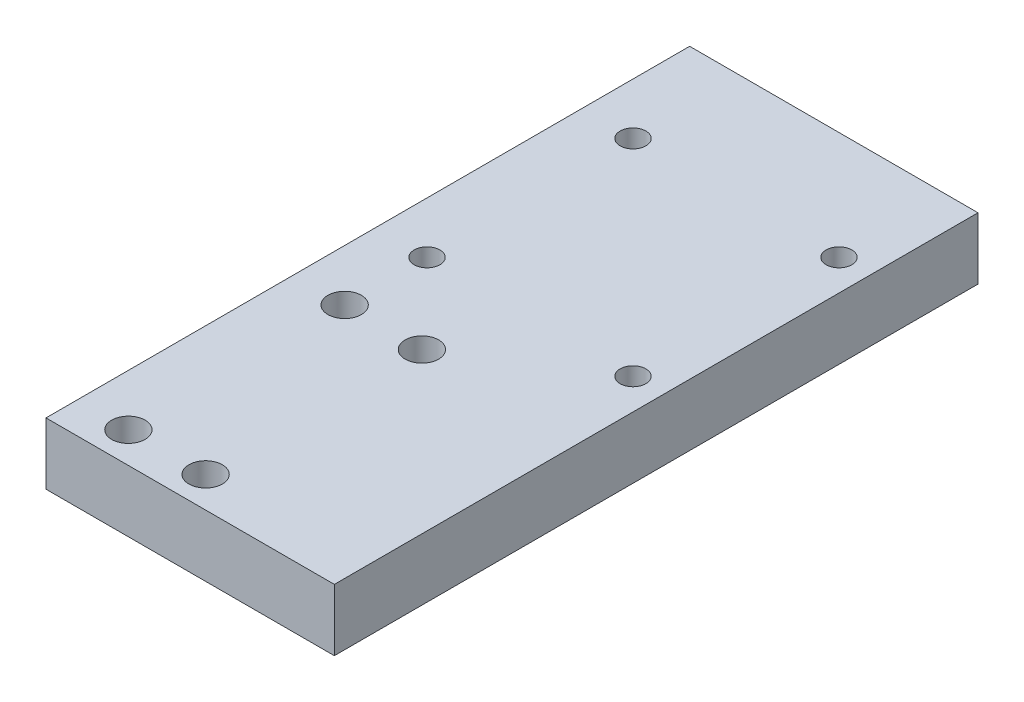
ISO-10303-21;
HEADER;
FILE_DESCRIPTION(('STEP AP214'),'2;1');
FILE_NAME('part.step','',(''),(''),'','','');
FILE_SCHEMA(('AUTOMOTIVE_DESIGN { 1 0 10303 214 1 1 1 1 }'));
ENDSEC;
DATA;
#1=APPLICATION_CONTEXT('core data for automotive mechanical design processes');
#2=APPLICATION_PROTOCOL_DEFINITION('international standard','automotive_design',2000,#1);
#3=PRODUCT_CONTEXT('',#1,'mechanical');
#4=PRODUCT('Part','Part','',(#3));
#5=PRODUCT_RELATED_PRODUCT_CATEGORY('part','',(#4));
#6=PRODUCT_DEFINITION_FORMATION('','',#4);
#7=PRODUCT_DEFINITION_CONTEXT('part definition',#1,'design');
#8=PRODUCT_DEFINITION('design','',#6,#7);
#9=PRODUCT_DEFINITION_SHAPE('','',#8);
#10=(LENGTH_UNIT() NAMED_UNIT(*) SI_UNIT(.MILLI.,.METRE.));
#11=(NAMED_UNIT(*) PLANE_ANGLE_UNIT() SI_UNIT($,.RADIAN.));
#12=(NAMED_UNIT(*) SI_UNIT($,.STERADIAN.) SOLID_ANGLE_UNIT());
#13=UNCERTAINTY_MEASURE_WITH_UNIT(LENGTH_MEASURE(1.E-05),#10,'distance_accuracy_value','');
#14=(GEOMETRIC_REPRESENTATION_CONTEXT(3) GLOBAL_UNCERTAINTY_ASSIGNED_CONTEXT((#13)) GLOBAL_UNIT_ASSIGNED_CONTEXT((#10,
#11,#12)) REPRESENTATION_CONTEXT('',''));
#15=CARTESIAN_POINT('',(0.,0.,0.));
#16=DIRECTION('',(0.,0.,1.));
#17=DIRECTION('',(1.,0.,0.));
#18=AXIS2_PLACEMENT_3D('',#15,#16,#17);
#19=CARTESIAN_POINT('',(10.0000000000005,-113.,77.));
#20=DIRECTION('',(0.,1.,0.));
#21=DIRECTION('',(-1.,0.,0.));
#22=AXIS2_PLACEMENT_3D('',#19,#20,#21);
#23=CYLINDRICAL_SURFACE('',#22,3.25);
#24=CARTESIAN_POINT('',(9.99999999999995,12.,77.));
#25=DIRECTION('',(0.,1.,0.));
#26=DIRECTION('',(-1.,0.,0.));
#27=AXIS2_PLACEMENT_3D('',#24,#25,#26);
#28=CIRCLE('',#27,3.25);
#29=CARTESIAN_POINT('',(6.74999999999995,12.,77.));
#30=VERTEX_POINT('',#29);
#31=EDGE_CURVE('E102',#30,#30,#28,.T.);
#32=ORIENTED_EDGE('',*,*,#31,.T.);
#33=EDGE_LOOP('',(#32));
#34=FACE_BOUND('',#33,.T.);
#35=CARTESIAN_POINT('',(9.99999999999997,6.50000000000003,77.));
#36=DIRECTION('',(0.,-1.,0.));
#37=DIRECTION('',(1.,0.,0.));
#38=AXIS2_PLACEMENT_3D('',#35,#36,#37);
#39=CIRCLE('',#38,3.25);
#40=CARTESIAN_POINT('',(13.25,6.50000000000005,77.));
#41=VERTEX_POINT('',#40);
#42=EDGE_CURVE('E36',#41,#41,#39,.F.);
#43=ORIENTED_EDGE('',*,*,#42,.F.);
#44=EDGE_LOOP('',(#43));
#45=FACE_BOUND('',#44,.T.);
#46=ADVANCED_FACE('F32',(#34,#45),#23,.F.);
#47=CARTESIAN_POINT('',(25.0000000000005,-113.,77.));
#48=DIRECTION('',(0.,1.,0.));
#49=DIRECTION('',(-1.,0.,0.));
#50=AXIS2_PLACEMENT_3D('',#47,#48,#49);
#51=CYLINDRICAL_SURFACE('',#50,3.25);
#52=CARTESIAN_POINT('',(25.,12.0000000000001,77.));
#53=DIRECTION('',(0.,1.,0.));
#54=DIRECTION('',(-1.,0.,0.));
#55=AXIS2_PLACEMENT_3D('',#52,#53,#54);
#56=CIRCLE('',#55,3.25);
#57=CARTESIAN_POINT('',(21.75,12.0000000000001,77.));
#58=VERTEX_POINT('',#57);
#59=EDGE_CURVE('E165',#58,#58,#56,.T.);
#60=ORIENTED_EDGE('',*,*,#59,.T.);
#61=EDGE_LOOP('',(#60));
#62=FACE_BOUND('',#61,.T.);
#63=CARTESIAN_POINT('',(25.,6.5000000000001,77.));
#64=DIRECTION('',(0.,-1.,0.));
#65=DIRECTION('',(1.,0.,0.));
#66=AXIS2_PLACEMENT_3D('',#63,#64,#65);
#67=CIRCLE('',#66,3.25);
#68=CARTESIAN_POINT('',(28.25,6.50000000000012,77.));
#69=VERTEX_POINT('',#68);
#70=EDGE_CURVE('E117',#69,#69,#67,.F.);
#71=ORIENTED_EDGE('',*,*,#70,.F.);
#72=EDGE_LOOP('',(#71));
#73=FACE_BOUND('',#72,.T.);
#74=ADVANCED_FACE('F191',(#62,#73),#51,.F.);
#75=CARTESIAN_POINT('',(25.0000000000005,-113.,119.));
#76=DIRECTION('',(0.,1.,0.));
#77=DIRECTION('',(-1.,0.,0.));
#78=AXIS2_PLACEMENT_3D('',#75,#76,#77);
#79=CYLINDRICAL_SURFACE('',#78,3.25);
#80=CARTESIAN_POINT('',(25.,12.0000000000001,119.));
#81=DIRECTION('',(0.,1.,0.));
#82=DIRECTION('',(-1.,0.,0.));
#83=AXIS2_PLACEMENT_3D('',#80,#81,#82);
#84=CIRCLE('',#83,3.25);
#85=CARTESIAN_POINT('',(21.75,12.0000000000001,119.));
#86=VERTEX_POINT('',#85);
#87=EDGE_CURVE('E168',#86,#86,#84,.T.);
#88=ORIENTED_EDGE('',*,*,#87,.T.);
#89=EDGE_LOOP('',(#88));
#90=FACE_BOUND('',#89,.T.);
#91=CARTESIAN_POINT('',(25.,6.5000000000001,119.));
#92=DIRECTION('',(0.,-1.,0.));
#93=DIRECTION('',(1.,0.,0.));
#94=AXIS2_PLACEMENT_3D('',#91,#92,#93);
#95=CIRCLE('',#94,3.25);
#96=CARTESIAN_POINT('',(28.25,6.50000000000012,119.));
#97=VERTEX_POINT('',#96);
#98=EDGE_CURVE('E113',#97,#97,#95,.F.);
#99=ORIENTED_EDGE('',*,*,#98,.F.);
#100=EDGE_LOOP('',(#99));
#101=FACE_BOUND('',#100,.T.);
#102=ADVANCED_FACE('F196',(#90,#101),#79,.F.);
#103=CARTESIAN_POINT('',(10.0000000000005,-113.,119.));
#104=DIRECTION('',(0.,1.,0.));
#105=DIRECTION('',(-1.,0.,0.));
#106=AXIS2_PLACEMENT_3D('',#103,#104,#105);
#107=CYLINDRICAL_SURFACE('',#106,3.25);
#108=CARTESIAN_POINT('',(9.99999999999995,12.,119.));
#109=DIRECTION('',(0.,1.,0.));
#110=DIRECTION('',(-1.,0.,0.));
#111=AXIS2_PLACEMENT_3D('',#108,#109,#110);
#112=CIRCLE('',#111,3.25);
#113=CARTESIAN_POINT('',(6.74999999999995,12.,119.));
#114=VERTEX_POINT('',#113);
#115=EDGE_CURVE('E171',#114,#114,#112,.T.);
#116=ORIENTED_EDGE('',*,*,#115,.T.);
#117=EDGE_LOOP('',(#116));
#118=FACE_BOUND('',#117,.T.);
#119=CARTESIAN_POINT('',(9.99999999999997,6.50000000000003,119.));
#120=DIRECTION('',(0.,-1.,0.));
#121=DIRECTION('',(1.,0.,0.));
#122=AXIS2_PLACEMENT_3D('',#119,#120,#121);
#123=CIRCLE('',#122,3.25);
#124=CARTESIAN_POINT('',(13.25,6.50000000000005,119.));
#125=VERTEX_POINT('',#124);
#126=EDGE_CURVE('E108',#125,#125,#123,.F.);
#127=ORIENTED_EDGE('',*,*,#126,.F.);
#128=EDGE_LOOP('',(#127));
#129=FACE_BOUND('',#128,.T.);
#130=ADVANCED_FACE('F201',(#118,#129),#107,.F.);
#131=CARTESIAN_POINT('',(0.,0.,125.));
#132=DIRECTION('',(0.,1.,0.));
#133=DIRECTION('',(-1.,0.,0.));
#134=AXIS2_PLACEMENT_3D('',#131,#132,#133);
#135=PLANE('',#134);
#136=CARTESIAN_POINT('',(10.,0.,77.));
#137=DIRECTION('',(0.,-1.,0.));
#138=DIRECTION('',(1.,0.,0.));
#139=AXIS2_PLACEMENT_3D('',#136,#137,#138);
#140=CIRCLE('',#139,5.5);
#141=CARTESIAN_POINT('',(15.5,0.,77.));
#142=VERTEX_POINT('',#141);
#143=EDGE_CURVE('E133',#142,#142,#140,.T.);
#144=ORIENTED_EDGE('',*,*,#143,.F.);
#145=EDGE_LOOP('',(#144));
#146=FACE_BOUND('',#145,.T.);
#147=CARTESIAN_POINT('',(25.,1.01506105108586E-13,77.));
#148=DIRECTION('',(0.,-1.,0.));
#149=DIRECTION('',(1.,0.,0.));
#150=AXIS2_PLACEMENT_3D('',#147,#148,#149);
#151=CIRCLE('',#150,5.5);
#152=CARTESIAN_POINT('',(30.5,1.24032728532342E-13,77.));
#153=VERTEX_POINT('',#152);
#154=EDGE_CURVE('E126',#153,#153,#151,.T.);
#155=ORIENTED_EDGE('',*,*,#154,.F.);
#156=EDGE_LOOP('',(#155));
#157=FACE_BOUND('',#156,.T.);
#158=CARTESIAN_POINT('',(25.,1.01506105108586E-13,119.));
#159=DIRECTION('',(0.,-1.,0.));
#160=DIRECTION('',(1.,0.,0.));
#161=AXIS2_PLACEMENT_3D('',#158,#159,#160);
#162=CIRCLE('',#161,5.5);
#163=CARTESIAN_POINT('',(30.5,1.24032728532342E-13,119.));
#164=VERTEX_POINT('',#163);
#165=EDGE_CURVE('E119',#164,#164,#162,.T.);
#166=ORIENTED_EDGE('',*,*,#165,.F.);
#167=EDGE_LOOP('',(#166));
#168=FACE_BOUND('',#167,.T.);
#169=CARTESIAN_POINT('',(10.,0.,119.));
#170=DIRECTION('',(0.,-1.,0.));
#171=DIRECTION('',(1.,0.,0.));
#172=AXIS2_PLACEMENT_3D('',#169,#170,#171);
#173=CIRCLE('',#172,5.5);
#174=CARTESIAN_POINT('',(15.5,0.,119.));
#175=VERTEX_POINT('',#174);
#176=EDGE_CURVE('E115',#175,#175,#173,.T.);
#177=ORIENTED_EDGE('',*,*,#176,.F.);
#178=EDGE_LOOP('',(#177));
#179=FACE_BOUND('',#178,.T.);
#180=CARTESIAN_POINT('',(10.,0.,61.));
#181=DIRECTION('',(0.,1.,0.));
#182=DIRECTION('',(-1.,0.,0.));
#183=AXIS2_PLACEMENT_3D('',#180,#181,#182);
#184=CIRCLE('',#183,2.5);
#185=CARTESIAN_POINT('',(7.5,0.,61.));
#186=VERTEX_POINT('',#185);
#187=EDGE_CURVE('E144',#186,#186,#184,.T.);
#188=ORIENTED_EDGE('',*,*,#187,.T.);
#189=EDGE_LOOP('',(#188));
#190=FACE_BOUND('',#189,.T.);
#191=CARTESIAN_POINT('',(50.,2.08166817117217E-13,61.));
#192=DIRECTION('',(0.,1.,0.));
#193=DIRECTION('',(-1.,0.,0.));
#194=AXIS2_PLACEMENT_3D('',#191,#192,#193);
#195=CIRCLE('',#194,2.5);
#196=CARTESIAN_POINT('',(47.5,1.98016206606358E-13,61.));
#197=VERTEX_POINT('',#196);
#198=EDGE_CURVE('E150',#197,#197,#195,.T.);
#199=ORIENTED_EDGE('',*,*,#198,.T.);
#200=EDGE_LOOP('',(#199));
#201=FACE_BOUND('',#200,.T.);
#202=CARTESIAN_POINT('',(50.,2.08166817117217E-13,21.));
#203=DIRECTION('',(0.,1.,0.));
#204=DIRECTION('',(-1.,0.,0.));
#205=AXIS2_PLACEMENT_3D('',#202,#203,#204);
#206=CIRCLE('',#205,2.5);
#207=CARTESIAN_POINT('',(47.5,1.98016206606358E-13,21.));
#208=VERTEX_POINT('',#207);
#209=EDGE_CURVE('E156',#208,#208,#206,.T.);
#210=ORIENTED_EDGE('',*,*,#209,.T.);
#211=EDGE_LOOP('',(#210));
#212=FACE_BOUND('',#211,.T.);
#213=CARTESIAN_POINT('',(10.,0.,21.));
#214=DIRECTION('',(0.,1.,0.));
#215=DIRECTION('',(-1.,0.,0.));
#216=AXIS2_PLACEMENT_3D('',#213,#214,#215);
#217=CIRCLE('',#216,2.5);
#218=CARTESIAN_POINT('',(7.5,0.,21.));
#219=VERTEX_POINT('',#218);
#220=EDGE_CURVE('E162',#219,#219,#217,.T.);
#221=ORIENTED_EDGE('',*,*,#220,.T.);
#222=EDGE_LOOP('',(#221));
#223=FACE_BOUND('',#222,.T.);
#224=DIRECTION('',(1.,0.,0.));
#225=VECTOR('',#224,1.);
#226=CARTESIAN_POINT('',(0.,0.,0.));
#227=LINE('',#226,#225);
#228=CARTESIAN_POINT('',(0.,0.,0.));
#229=VERTEX_POINT('',#228);
#230=CARTESIAN_POINT('',(56.,2.27373675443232E-13,0.));
#231=VERTEX_POINT('',#230);
#232=EDGE_CURVE('E99',#229,#231,#227,.T.);
#233=ORIENTED_EDGE('',*,*,#232,.T.);
#234=DIRECTION('',(0.,0.,-1.));
#235=VECTOR('',#234,1.);
#236=CARTESIAN_POINT('',(56.,2.27373675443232E-13,125.));
#237=LINE('',#236,#235);
#238=CARTESIAN_POINT('',(56.,2.27373675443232E-13,125.));
#239=VERTEX_POINT('',#238);
#240=EDGE_CURVE('E11',#239,#231,#237,.T.);
#241=ORIENTED_EDGE('',*,*,#240,.F.);
#242=DIRECTION('',(1.,0.,0.));
#243=VECTOR('',#242,1.);
#244=CARTESIAN_POINT('',(0.,0.,125.));
#245=LINE('',#244,#243);
#246=CARTESIAN_POINT('',(0.,0.,125.));
#247=VERTEX_POINT('',#246);
#248=EDGE_CURVE('E86',#247,#239,#245,.T.);
#249=ORIENTED_EDGE('',*,*,#248,.F.);
#250=DIRECTION('',(0.,0.,-1.));
#251=VECTOR('',#250,1.);
#252=CARTESIAN_POINT('',(0.,0.,125.));
#253=LINE('',#252,#251);
#254=EDGE_CURVE('E95',#247,#229,#253,.T.);
#255=ORIENTED_EDGE('',*,*,#254,.T.);
#256=EDGE_LOOP('',(#233,#241,#249,#255));
#257=FACE_BOUND('',#256,.T.);
#258=ADVANCED_FACE('F34',(#146,#157,#168,#179,#190,#201,#212,#223,#257),#135,.F.);
#259=CARTESIAN_POINT('',(56.,2.27373675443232E-13,125.));
#260=DIRECTION('',(-1.,0.,0.));
#261=DIRECTION('',(0.,0.,1.));
#262=AXIS2_PLACEMENT_3D('',#259,#260,#261);
#263=PLANE('',#262);
#264=DIRECTION('',(0.,1.,0.));
#265=VECTOR('',#264,1.);
#266=CARTESIAN_POINT('',(56.,2.27373675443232E-13,0.));
#267=LINE('',#266,#265);
#268=CARTESIAN_POINT('',(56.,12.0000000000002,0.));
#269=VERTEX_POINT('',#268);
#270=EDGE_CURVE('E90',#231,#269,#267,.T.);
#271=ORIENTED_EDGE('',*,*,#270,.T.);
#272=DIRECTION('',(0.,0.,-1.));
#273=VECTOR('',#272,1.);
#274=CARTESIAN_POINT('',(56.,12.0000000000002,125.));
#275=LINE('',#274,#273);
#276=CARTESIAN_POINT('',(56.,12.0000000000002,125.));
#277=VERTEX_POINT('',#276);
#278=EDGE_CURVE('E42',#277,#269,#275,.T.);
#279=ORIENTED_EDGE('',*,*,#278,.F.);
#280=DIRECTION('',(0.,1.,0.));
#281=VECTOR('',#280,1.);
#282=CARTESIAN_POINT('',(56.,2.27373675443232E-13,125.));
#283=LINE('',#282,#281);
#284=EDGE_CURVE('E81',#239,#277,#283,.T.);
#285=ORIENTED_EDGE('',*,*,#284,.F.);
#286=ORIENTED_EDGE('',*,*,#240,.T.);
#287=EDGE_LOOP('',(#271,#279,#285,#286));
#288=FACE_BOUND('',#287,.T.);
#289=ADVANCED_FACE('F89',(#288),#263,.F.);
#290=CARTESIAN_POINT('',(0.,12.,125.));
#291=DIRECTION('',(0.,-1.,0.));
#292=DIRECTION('',(1.,0.,0.));
#293=AXIS2_PLACEMENT_3D('',#290,#291,#292);
#294=PLANE('',#293);
#295=CARTESIAN_POINT('',(9.99999999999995,12.,61.));
#296=DIRECTION('',(0.,1.,0.));
#297=DIRECTION('',(-1.,0.,0.));
#298=AXIS2_PLACEMENT_3D('',#295,#296,#297);
#299=CIRCLE('',#298,2.5);
#300=CARTESIAN_POINT('',(7.49999999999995,12.,61.));
#301=VERTEX_POINT('',#300);
#302=EDGE_CURVE('E111',#301,#301,#299,.T.);
#303=ORIENTED_EDGE('',*,*,#302,.F.);
#304=EDGE_LOOP('',(#303));
#305=FACE_BOUND('',#304,.T.);
#306=CARTESIAN_POINT('',(50.,12.0000000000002,61.));
#307=DIRECTION('',(0.,1.,0.));
#308=DIRECTION('',(-1.,0.,0.));
#309=AXIS2_PLACEMENT_3D('',#306,#307,#308);
#310=CIRCLE('',#309,2.5);
#311=CARTESIAN_POINT('',(47.5,12.0000000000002,61.));
#312=VERTEX_POINT('',#311);
#313=EDGE_CURVE('E147',#312,#312,#310,.T.);
#314=ORIENTED_EDGE('',*,*,#313,.F.);
#315=EDGE_LOOP('',(#314));
#316=FACE_BOUND('',#315,.T.);
#317=CARTESIAN_POINT('',(50.,12.0000000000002,21.));
#318=DIRECTION('',(0.,1.,0.));
#319=DIRECTION('',(-1.,0.,0.));
#320=AXIS2_PLACEMENT_3D('',#317,#318,#319);
#321=CIRCLE('',#320,2.5);
#322=CARTESIAN_POINT('',(47.5,12.0000000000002,21.));
#323=VERTEX_POINT('',#322);
#324=EDGE_CURVE('E153',#323,#323,#321,.T.);
#325=ORIENTED_EDGE('',*,*,#324,.F.);
#326=EDGE_LOOP('',(#325));
#327=FACE_BOUND('',#326,.T.);
#328=CARTESIAN_POINT('',(9.99999999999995,12.,21.));
#329=DIRECTION('',(0.,1.,0.));
#330=DIRECTION('',(-1.,0.,0.));
#331=AXIS2_PLACEMENT_3D('',#328,#329,#330);
#332=CIRCLE('',#331,2.5);
#333=CARTESIAN_POINT('',(7.49999999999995,12.,21.));
#334=VERTEX_POINT('',#333);
#335=EDGE_CURVE('E159',#334,#334,#332,.T.);
#336=ORIENTED_EDGE('',*,*,#335,.F.);
#337=EDGE_LOOP('',(#336));
#338=FACE_BOUND('',#337,.T.);
#339=ORIENTED_EDGE('',*,*,#59,.F.);
#340=EDGE_LOOP('',(#339));
#341=FACE_BOUND('',#340,.T.);
#342=ORIENTED_EDGE('',*,*,#87,.F.);
#343=EDGE_LOOP('',(#342));
#344=FACE_BOUND('',#343,.T.);
#345=ORIENTED_EDGE('',*,*,#115,.F.);
#346=EDGE_LOOP('',(#345));
#347=FACE_BOUND('',#346,.T.);
#348=ORIENTED_EDGE('',*,*,#31,.F.);
#349=EDGE_LOOP('',(#348));
#350=FACE_BOUND('',#349,.T.);
#351=DIRECTION('',(-1.,0.,0.));
#352=VECTOR('',#351,1.);
#353=CARTESIAN_POINT('',(0.,12.,0.));
#354=LINE('',#353,#352);
#355=CARTESIAN_POINT('',(0.,12.,0.));
#356=VERTEX_POINT('',#355);
#357=EDGE_CURVE('E68',#269,#356,#354,.T.);
#358=ORIENTED_EDGE('',*,*,#357,.T.);
#359=DIRECTION('',(0.,0.,-1.));
#360=VECTOR('',#359,1.);
#361=CARTESIAN_POINT('',(0.,12.,125.));
#362=LINE('',#361,#360);
#363=CARTESIAN_POINT('',(0.,12.,125.));
#364=VERTEX_POINT('',#363);
#365=EDGE_CURVE('E91',#364,#356,#362,.T.);
#366=ORIENTED_EDGE('',*,*,#365,.F.);
#367=DIRECTION('',(-1.,0.,0.));
#368=VECTOR('',#367,1.);
#369=CARTESIAN_POINT('',(0.,12.,125.));
#370=LINE('',#369,#368);
#371=EDGE_CURVE('E84',#277,#364,#370,.T.);
#372=ORIENTED_EDGE('',*,*,#371,.F.);
#373=ORIENTED_EDGE('',*,*,#278,.T.);
#374=EDGE_LOOP('',(#358,#366,#372,#373));
#375=FACE_BOUND('',#374,.T.);
#376=ADVANCED_FACE('F93',(#305,#316,#327,#338,#341,#344,#347,#350,#375),#294,.F.);
#377=CARTESIAN_POINT('',(0.,0.,125.));
#378=DIRECTION('',(1.,0.,0.));
#379=DIRECTION('',(0.,0.,-1.));
#380=AXIS2_PLACEMENT_3D('',#377,#378,#379);
#381=PLANE('',#380);
#382=DIRECTION('',(0.,-1.,0.));
#383=VECTOR('',#382,1.);
#384=CARTESIAN_POINT('',(0.,0.,0.));
#385=LINE('',#384,#383);
#386=EDGE_CURVE('E74',#356,#229,#385,.T.);
#387=ORIENTED_EDGE('',*,*,#386,.T.);
#388=ORIENTED_EDGE('',*,*,#254,.F.);
#389=DIRECTION('',(0.,-1.,0.));
#390=VECTOR('',#389,1.);
#391=CARTESIAN_POINT('',(0.,0.,125.));
#392=LINE('',#391,#390);
#393=EDGE_CURVE('E51',#364,#247,#392,.T.);
#394=ORIENTED_EDGE('',*,*,#393,.F.);
#395=ORIENTED_EDGE('',*,*,#365,.T.);
#396=EDGE_LOOP('',(#387,#388,#394,#395));
#397=FACE_BOUND('',#396,.T.);
#398=ADVANCED_FACE('F180',(#397),#381,.F.);
#399=CARTESIAN_POINT('',(56.,2.27373675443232E-13,125.));
#400=DIRECTION('',(0.,0.,1.));
#401=DIRECTION('',(1.,0.,0.));
#402=AXIS2_PLACEMENT_3D('',#399,#400,#401);
#403=PLANE('',#402);
#404=ORIENTED_EDGE('',*,*,#248,.T.);
#405=ORIENTED_EDGE('',*,*,#284,.T.);
#406=ORIENTED_EDGE('',*,*,#371,.T.);
#407=ORIENTED_EDGE('',*,*,#393,.T.);
#408=EDGE_LOOP('',(#404,#405,#406,#407));
#409=FACE_BOUND('',#408,.T.);
#410=ADVANCED_FACE('F82',(#409),#403,.T.);
#411=CARTESIAN_POINT('',(56.,2.27373675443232E-13,0.));
#412=DIRECTION('',(0.,0.,1.));
#413=DIRECTION('',(1.,0.,0.));
#414=AXIS2_PLACEMENT_3D('',#411,#412,#413);
#415=PLANE('',#414);
#416=CARTESIAN_POINT('',(6.,6.00000000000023,0.));
#417=DIRECTION('',(0.,0.,-1.));
#418=DIRECTION('',(-1.,0.,0.));
#419=AXIS2_PLACEMENT_3D('',#416,#417,#418);
#420=CIRCLE('',#419,2.10000000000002);
#421=CARTESIAN_POINT('',(3.89999999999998,6.00000000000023,0.));
#422=VERTEX_POINT('',#421);
#423=EDGE_CURVE('E218',#422,#422,#420,.T.);
#424=ORIENTED_EDGE('',*,*,#423,.F.);
#425=EDGE_LOOP('',(#424));
#426=FACE_BOUND('',#425,.T.);
#427=CARTESIAN_POINT('',(24.0000000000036,6.00000000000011,0.));
#428=DIRECTION('',(0.,0.,-1.));
#429=DIRECTION('',(-1.,0.,0.));
#430=AXIS2_PLACEMENT_3D('',#427,#428,#429);
#431=CIRCLE('',#430,2.10000000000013);
#432=CARTESIAN_POINT('',(21.9000000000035,6.00000000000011,0.));
#433=VERTEX_POINT('',#432);
#434=EDGE_CURVE('E222',#433,#433,#431,.T.);
#435=ORIENTED_EDGE('',*,*,#434,.F.);
#436=EDGE_LOOP('',(#435));
#437=FACE_BOUND('',#436,.T.);
#438=ORIENTED_EDGE('',*,*,#232,.F.);
#439=ORIENTED_EDGE('',*,*,#386,.F.);
#440=ORIENTED_EDGE('',*,*,#357,.F.);
#441=ORIENTED_EDGE('',*,*,#270,.F.);
#442=EDGE_LOOP('',(#438,#439,#440,#441));
#443=FACE_BOUND('',#442,.T.);
#444=ADVANCED_FACE('F205',(#426,#437,#443),#415,.F.);
#445=CARTESIAN_POINT('',(10.0000000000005,-113.,21.));
#446=DIRECTION('',(0.,1.,0.));
#447=DIRECTION('',(-1.,0.,0.));
#448=AXIS2_PLACEMENT_3D('',#445,#446,#447);
#449=CYLINDRICAL_SURFACE('',#448,2.5);
#450=ORIENTED_EDGE('',*,*,#335,.T.);
#451=EDGE_LOOP('',(#450));
#452=FACE_BOUND('',#451,.T.);
#453=ORIENTED_EDGE('',*,*,#220,.F.);
#454=EDGE_LOOP('',(#453));
#455=FACE_BOUND('',#454,.T.);
#456=ADVANCED_FACE('F207',(#452,#455),#449,.F.);
#457=CARTESIAN_POINT('',(50.0000000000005,-113.,21.));
#458=DIRECTION('',(0.,1.,0.));
#459=DIRECTION('',(-1.,0.,0.));
#460=AXIS2_PLACEMENT_3D('',#457,#458,#459);
#461=CYLINDRICAL_SURFACE('',#460,2.5);
#462=ORIENTED_EDGE('',*,*,#324,.T.);
#463=EDGE_LOOP('',(#462));
#464=FACE_BOUND('',#463,.T.);
#465=ORIENTED_EDGE('',*,*,#209,.F.);
#466=EDGE_LOOP('',(#465));
#467=FACE_BOUND('',#466,.T.);
#468=ADVANCED_FACE('F212',(#464,#467),#461,.F.);
#469=CARTESIAN_POINT('',(50.0000000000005,-113.,61.));
#470=DIRECTION('',(0.,1.,0.));
#471=DIRECTION('',(-1.,0.,0.));
#472=AXIS2_PLACEMENT_3D('',#469,#470,#471);
#473=CYLINDRICAL_SURFACE('',#472,2.5);
#474=ORIENTED_EDGE('',*,*,#313,.T.);
#475=EDGE_LOOP('',(#474));
#476=FACE_BOUND('',#475,.T.);
#477=ORIENTED_EDGE('',*,*,#198,.F.);
#478=EDGE_LOOP('',(#477));
#479=FACE_BOUND('',#478,.T.);
#480=ADVANCED_FACE('F250',(#476,#479),#473,.F.);
#481=CARTESIAN_POINT('',(10.0000000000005,-113.,61.));
#482=DIRECTION('',(0.,1.,0.));
#483=DIRECTION('',(-1.,0.,0.));
#484=AXIS2_PLACEMENT_3D('',#481,#482,#483);
#485=CYLINDRICAL_SURFACE('',#484,2.5);
#486=ORIENTED_EDGE('',*,*,#302,.T.);
#487=EDGE_LOOP('',(#486));
#488=FACE_BOUND('',#487,.T.);
#489=ORIENTED_EDGE('',*,*,#187,.F.);
#490=EDGE_LOOP('',(#489));
#491=FACE_BOUND('',#490,.T.);
#492=ADVANCED_FACE('F256',(#488,#491),#485,.F.);
#493=CARTESIAN_POINT('',(9.99999999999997,6.50000000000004,119.));
#494=DIRECTION('',(0.,-1.,0.));
#495=DIRECTION('',(1.,0.,0.));
#496=AXIS2_PLACEMENT_3D('',#493,#494,#495);
#497=PLANE('',#496);
#498=CARTESIAN_POINT('',(9.99999999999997,6.50000000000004,119.));
#499=DIRECTION('',(0.,-1.,0.));
#500=DIRECTION('',(1.,0.,0.));
#501=AXIS2_PLACEMENT_3D('',#498,#499,#500);
#502=CIRCLE('',#501,5.5);
#503=CARTESIAN_POINT('',(15.5,6.50000000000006,119.));
#504=VERTEX_POINT('',#503);
#505=EDGE_CURVE('E112',#504,#504,#502,.T.);
#506=ORIENTED_EDGE('',*,*,#505,.T.);
#507=EDGE_LOOP('',(#506));
#508=FACE_BOUND('',#507,.T.);
#509=ORIENTED_EDGE('',*,*,#126,.T.);
#510=EDGE_LOOP('',(#509));
#511=FACE_BOUND('',#510,.T.);
#512=ADVANCED_FACE('F281',(#508,#511),#497,.T.);
#513=CARTESIAN_POINT('',(9.99999999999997,6.50000000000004,119.));
#514=DIRECTION('',(0.,-1.,0.));
#515=DIRECTION('',(1.,0.,0.));
#516=AXIS2_PLACEMENT_3D('',#513,#514,#515);
#517=CYLINDRICAL_SURFACE('',#516,5.5);
#518=CARTESIAN_POINT('',(15.5,6.50000000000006,119.));
#519=CARTESIAN_POINT('',(15.5,6.43229166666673,119.));
#520=CARTESIAN_POINT('',(15.5,6.3645833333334,119.));
#521=CARTESIAN_POINT('',(15.5,6.22916666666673,119.));
#522=CARTESIAN_POINT('',(15.5,6.1614583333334,119.));
#523=CARTESIAN_POINT('',(15.5,6.02604166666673,119.));
#524=CARTESIAN_POINT('',(15.5,5.9583333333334,119.));
#525=CARTESIAN_POINT('',(15.5,5.82291666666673,119.));
#526=CARTESIAN_POINT('',(15.5,5.7552083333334,119.));
#527=CARTESIAN_POINT('',(15.5,5.61979166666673,119.));
#528=CARTESIAN_POINT('',(15.5,5.5520833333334,119.));
#529=CARTESIAN_POINT('',(15.5,5.41666666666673,119.));
#530=CARTESIAN_POINT('',(15.5,5.3489583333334,119.));
#531=CARTESIAN_POINT('',(15.5,5.21354166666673,119.));
#532=CARTESIAN_POINT('',(15.5,5.1458333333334,119.));
#533=CARTESIAN_POINT('',(15.5,5.01041666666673,119.));
#534=CARTESIAN_POINT('',(15.5,4.9427083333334,119.));
#535=CARTESIAN_POINT('',(15.5,4.80729166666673,119.));
#536=CARTESIAN_POINT('',(15.5,4.7395833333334,119.));
#537=CARTESIAN_POINT('',(15.5,4.60416666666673,119.));
#538=CARTESIAN_POINT('',(15.5,4.5364583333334,119.));
#539=CARTESIAN_POINT('',(15.5,4.40104166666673,119.));
#540=CARTESIAN_POINT('',(15.5,4.3333333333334,119.));
#541=CARTESIAN_POINT('',(15.5,4.19791666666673,119.));
#542=CARTESIAN_POINT('',(15.5,4.1302083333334,119.));
#543=CARTESIAN_POINT('',(15.5,3.99479166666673,119.));
#544=CARTESIAN_POINT('',(15.5,3.9270833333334,119.));
#545=CARTESIAN_POINT('',(15.5,3.79166666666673,119.));
#546=CARTESIAN_POINT('',(15.5,3.7239583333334,119.));
#547=CARTESIAN_POINT('',(15.5,3.58854166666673,119.));
#548=CARTESIAN_POINT('',(15.5,3.5208333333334,119.));
#549=CARTESIAN_POINT('',(15.5,3.38541666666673,119.));
#550=CARTESIAN_POINT('',(15.5,3.3177083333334,119.));
#551=CARTESIAN_POINT('',(15.5,3.18229166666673,119.));
#552=CARTESIAN_POINT('',(15.5,3.1145833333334,119.));
#553=CARTESIAN_POINT('',(15.5,2.97916666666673,119.));
#554=CARTESIAN_POINT('',(15.5,2.9114583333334,119.));
#555=CARTESIAN_POINT('',(15.5,2.77604166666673,119.));
#556=CARTESIAN_POINT('',(15.5,2.7083333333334,119.));
#557=CARTESIAN_POINT('',(15.5,2.57291666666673,119.));
#558=CARTESIAN_POINT('',(15.5,2.5052083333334,119.));
#559=CARTESIAN_POINT('',(15.5,2.36979166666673,119.));
#560=CARTESIAN_POINT('',(15.5,2.3020833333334,119.));
#561=CARTESIAN_POINT('',(15.5,2.16666666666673,119.));
#562=CARTESIAN_POINT('',(15.5,2.0989583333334,119.));
#563=CARTESIAN_POINT('',(15.5,1.96354166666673,119.));
#564=CARTESIAN_POINT('',(15.5,1.8958333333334,119.));
#565=CARTESIAN_POINT('',(15.5,1.76041666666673,119.));
#566=CARTESIAN_POINT('',(15.5,1.6927083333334,119.));
#567=CARTESIAN_POINT('',(15.5,1.55729166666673,119.));
#568=CARTESIAN_POINT('',(15.5,1.4895833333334,119.));
#569=CARTESIAN_POINT('',(15.5,1.35416666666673,119.));
#570=CARTESIAN_POINT('',(15.5,1.2864583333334,119.));
#571=CARTESIAN_POINT('',(15.5,1.15104166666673,119.));
#572=CARTESIAN_POINT('',(15.5,1.0833333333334,119.));
#573=CARTESIAN_POINT('',(15.5,0.94791666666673,119.));
#574=CARTESIAN_POINT('',(15.5,0.880208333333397,119.));
#575=CARTESIAN_POINT('',(15.5,0.74479166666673,119.));
#576=CARTESIAN_POINT('',(15.5,0.677083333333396,119.));
#577=CARTESIAN_POINT('',(15.5,0.54166666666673,119.));
#578=CARTESIAN_POINT('',(15.5,0.473958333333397,119.));
#579=CARTESIAN_POINT('',(15.5,0.33854166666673,119.));
#580=CARTESIAN_POINT('',(15.5,0.270833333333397,119.));
#581=CARTESIAN_POINT('',(15.5,0.13541666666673,119.));
#582=CARTESIAN_POINT('',(15.5,0.0677083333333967,119.));
#583=CARTESIAN_POINT('',(15.5,0.,119.));
#584=B_SPLINE_CURVE_WITH_KNOTS('',3,(#518,#519,#520,#521,#522,#523,#524,#525,#526,#527,#528,
#529,#530,#531,#532,#533,#534,#535,#536,#537,#538,#539,#540,#541,#542,#543,#544,#545,#546,#547,
#548,#549,#550,#551,#552,#553,#554,#555,#556,#557,#558,#559,#560,#561,#562,#563,#564,#565,#566,
#567,#568,#569,#570,#571,#572,#573,#574,#575,#576,#577,#578,#579,#580,#581,#582,#583),
.UNSPECIFIED.,.F.,.F.,(4,2,2,2,2,2,2,2,2,2,2,2,2,2,2,2,2,2,2,2,2,2,2,2,2,2,2,2,2,2,2,2,4),(0.,
0.203125,0.40625,0.609375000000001,0.812500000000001,1.015625,1.21875,1.421875,1.625,1.828125,
2.03125,2.234375,2.4375,2.640625,2.84375,3.046875,3.25,3.453125,3.65625,3.859375,4.0625,
4.265625,4.46875,4.671875,4.875,5.078125,5.28125,5.484375,5.6875,5.890625,6.09375,6.296875,6.5),.UNSPECIFIED.);
#585=EDGE_CURVE('BSEAM271',#504,#175,#584,.T.);
#586=ORIENTED_EDGE('',*,*,#505,.F.);
#587=ORIENTED_EDGE('',*,*,#176,.T.);
#588=ORIENTED_EDGE('',*,*,#585,.T.);
#589=ORIENTED_EDGE('',*,*,#585,.F.);
#590=EDGE_LOOP('',(#586,#588,#587,#589));
#591=FACE_BOUND('',#590,.T.);
#592=ADVANCED_FACE('F271',(#591),#517,.F.);
#593=CARTESIAN_POINT('',(25.,6.5000000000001,119.));
#594=DIRECTION('',(0.,-1.,0.));
#595=DIRECTION('',(1.,0.,0.));
#596=AXIS2_PLACEMENT_3D('',#593,#594,#595);
#597=PLANE('',#596);
#598=CARTESIAN_POINT('',(25.,6.5000000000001,119.));
#599=DIRECTION('',(0.,-1.,0.));
#600=DIRECTION('',(1.,0.,0.));
#601=AXIS2_PLACEMENT_3D('',#598,#599,#600);
#602=CIRCLE('',#601,5.5);
#603=CARTESIAN_POINT('',(30.5,6.50000000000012,119.));
#604=VERTEX_POINT('',#603);
#605=EDGE_CURVE('E116',#604,#604,#602,.T.);
#606=ORIENTED_EDGE('',*,*,#605,.T.);
#607=EDGE_LOOP('',(#606));
#608=FACE_BOUND('',#607,.T.);
#609=ORIENTED_EDGE('',*,*,#98,.T.);
#610=EDGE_LOOP('',(#609));
#611=FACE_BOUND('',#610,.T.);
#612=ADVANCED_FACE('F268',(#608,#611),#597,.T.);
#613=CARTESIAN_POINT('',(25.,6.5000000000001,119.));
#614=DIRECTION('',(0.,-1.,0.));
#615=DIRECTION('',(1.,0.,0.));
#616=AXIS2_PLACEMENT_3D('',#613,#614,#615);
#617=CYLINDRICAL_SURFACE('',#616,5.5);
#618=CARTESIAN_POINT('',(30.5,6.50000000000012,119.));
#619=CARTESIAN_POINT('',(30.5,6.43229166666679,119.));
#620=CARTESIAN_POINT('',(30.5,6.36458333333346,119.));
#621=CARTESIAN_POINT('',(30.5,6.22916666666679,119.));
#622=CARTESIAN_POINT('',(30.5,6.16145833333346,119.));
#623=CARTESIAN_POINT('',(30.5,6.02604166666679,119.));
#624=CARTESIAN_POINT('',(30.5,5.95833333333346,119.));
#625=CARTESIAN_POINT('',(30.5,5.82291666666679,119.));
#626=CARTESIAN_POINT('',(30.5,5.75520833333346,119.));
#627=CARTESIAN_POINT('',(30.5,5.61979166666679,119.));
#628=CARTESIAN_POINT('',(30.5,5.55208333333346,119.));
#629=CARTESIAN_POINT('',(30.5,5.41666666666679,119.));
#630=CARTESIAN_POINT('',(30.5,5.34895833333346,119.));
#631=CARTESIAN_POINT('',(30.5,5.21354166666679,119.));
#632=CARTESIAN_POINT('',(30.5,5.14583333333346,119.));
#633=CARTESIAN_POINT('',(30.5,5.01041666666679,119.));
#634=CARTESIAN_POINT('',(30.5,4.94270833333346,119.));
#635=CARTESIAN_POINT('',(30.5,4.80729166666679,119.));
#636=CARTESIAN_POINT('',(30.5,4.73958333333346,119.));
#637=CARTESIAN_POINT('',(30.5,4.60416666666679,119.));
#638=CARTESIAN_POINT('',(30.5,4.53645833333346,119.));
#639=CARTESIAN_POINT('',(30.5,4.40104166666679,119.));
#640=CARTESIAN_POINT('',(30.5,4.33333333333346,119.));
#641=CARTESIAN_POINT('',(30.5,4.19791666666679,119.));
#642=CARTESIAN_POINT('',(30.5,4.13020833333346,119.));
#643=CARTESIAN_POINT('',(30.5,3.99479166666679,119.));
#644=CARTESIAN_POINT('',(30.5,3.92708333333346,119.));
#645=CARTESIAN_POINT('',(30.5,3.79166666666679,119.));
#646=CARTESIAN_POINT('',(30.5,3.72395833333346,119.));
#647=CARTESIAN_POINT('',(30.5,3.58854166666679,119.));
#648=CARTESIAN_POINT('',(30.5,3.52083333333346,119.));
#649=CARTESIAN_POINT('',(30.5,3.38541666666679,119.));
#650=CARTESIAN_POINT('',(30.5,3.31770833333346,119.));
#651=CARTESIAN_POINT('',(30.5,3.18229166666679,119.));
#652=CARTESIAN_POINT('',(30.5,3.11458333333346,119.));
#653=CARTESIAN_POINT('',(30.5,2.97916666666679,119.));
#654=CARTESIAN_POINT('',(30.5,2.91145833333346,119.));
#655=CARTESIAN_POINT('',(30.5,2.77604166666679,119.));
#656=CARTESIAN_POINT('',(30.5,2.70833333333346,119.));
#657=CARTESIAN_POINT('',(30.5,2.57291666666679,119.));
#658=CARTESIAN_POINT('',(30.5,2.50520833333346,119.));
#659=CARTESIAN_POINT('',(30.5,2.36979166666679,119.));
#660=CARTESIAN_POINT('',(30.5,2.30208333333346,119.));
#661=CARTESIAN_POINT('',(30.5,2.16666666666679,119.));
#662=CARTESIAN_POINT('',(30.5,2.09895833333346,119.));
#663=CARTESIAN_POINT('',(30.5,1.96354166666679,119.));
#664=CARTESIAN_POINT('',(30.5,1.89583333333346,119.));
#665=CARTESIAN_POINT('',(30.5,1.76041666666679,119.));
#666=CARTESIAN_POINT('',(30.5,1.69270833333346,119.));
#667=CARTESIAN_POINT('',(30.5,1.55729166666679,119.));
#668=CARTESIAN_POINT('',(30.5,1.48958333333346,119.));
#669=CARTESIAN_POINT('',(30.5,1.35416666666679,119.));
#670=CARTESIAN_POINT('',(30.5,1.28645833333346,119.));
#671=CARTESIAN_POINT('',(30.5,1.15104166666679,119.));
#672=CARTESIAN_POINT('',(30.5,1.08333333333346,119.));
#673=CARTESIAN_POINT('',(30.5,0.947916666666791,119.));
#674=CARTESIAN_POINT('',(30.5,0.880208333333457,119.));
#675=CARTESIAN_POINT('',(30.5,0.744791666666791,119.));
#676=CARTESIAN_POINT('',(30.5,0.677083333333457,119.));
#677=CARTESIAN_POINT('',(30.5,0.541666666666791,119.));
#678=CARTESIAN_POINT('',(30.5,0.473958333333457,119.));
#679=CARTESIAN_POINT('',(30.5,0.338541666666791,119.));
#680=CARTESIAN_POINT('',(30.5,0.270833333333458,119.));
#681=CARTESIAN_POINT('',(30.5,0.135416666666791,119.));
#682=CARTESIAN_POINT('',(30.5,0.0677083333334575,119.));
#683=CARTESIAN_POINT('',(30.5,1.24032728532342E-13,119.));
#684=B_SPLINE_CURVE_WITH_KNOTS('',3,(#618,#619,#620,#621,#622,#623,#624,#625,#626,#627,#628,
#629,#630,#631,#632,#633,#634,#635,#636,#637,#638,#639,#640,#641,#642,#643,#644,#645,#646,#647,
#648,#649,#650,#651,#652,#653,#654,#655,#656,#657,#658,#659,#660,#661,#662,#663,#664,#665,#666,
#667,#668,#669,#670,#671,#672,#673,#674,#675,#676,#677,#678,#679,#680,#681,#682,#683),
.UNSPECIFIED.,.F.,.F.,(4,2,2,2,2,2,2,2,2,2,2,2,2,2,2,2,2,2,2,2,2,2,2,2,2,2,2,2,2,2,2,2,4),(0.,
0.203125,0.40625,0.609375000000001,0.812500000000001,1.015625,1.21875,1.421875,1.625,1.828125,
2.03125,2.234375,2.4375,2.640625,2.84375,3.046875,3.25,3.453125,3.65625,3.859375,4.0625,
4.265625,4.46875,4.671875,4.875,5.078125,5.28125,5.484375,5.6875,5.890625,6.09375,6.296875,6.5),.UNSPECIFIED.);
#685=EDGE_CURVE('BSEAM270',#604,#164,#684,.T.);
#686=ORIENTED_EDGE('',*,*,#605,.F.);
#687=ORIENTED_EDGE('',*,*,#165,.T.);
#688=ORIENTED_EDGE('',*,*,#685,.T.);
#689=ORIENTED_EDGE('',*,*,#685,.F.);
#690=EDGE_LOOP('',(#686,#688,#687,#689));
#691=FACE_BOUND('',#690,.T.);
#692=ADVANCED_FACE('F270',(#691),#617,.F.);
#693=CARTESIAN_POINT('',(25.,6.5000000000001,77.));
#694=DIRECTION('',(0.,-1.,0.));
#695=DIRECTION('',(1.,0.,0.));
#696=AXIS2_PLACEMENT_3D('',#693,#694,#695);
#697=PLANE('',#696);
#698=CARTESIAN_POINT('',(25.,6.5000000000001,77.));
#699=DIRECTION('',(0.,-1.,0.));
#700=DIRECTION('',(1.,0.,0.));
#701=AXIS2_PLACEMENT_3D('',#698,#699,#700);
#702=CIRCLE('',#701,5.5);
#703=CARTESIAN_POINT('',(30.5,6.50000000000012,77.));
#704=VERTEX_POINT('',#703);
#705=EDGE_CURVE('E120',#704,#704,#702,.T.);
#706=ORIENTED_EDGE('',*,*,#705,.T.);
#707=EDGE_LOOP('',(#706));
#708=FACE_BOUND('',#707,.T.);
#709=ORIENTED_EDGE('',*,*,#70,.T.);
#710=EDGE_LOOP('',(#709));
#711=FACE_BOUND('',#710,.T.);
#712=ADVANCED_FACE('F278',(#708,#711),#697,.T.);
#713=CARTESIAN_POINT('',(25.,6.5000000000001,77.));
#714=DIRECTION('',(0.,-1.,0.));
#715=DIRECTION('',(1.,0.,0.));
#716=AXIS2_PLACEMENT_3D('',#713,#714,#715);
#717=CYLINDRICAL_SURFACE('',#716,5.5);
#718=CARTESIAN_POINT('',(30.5,6.50000000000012,77.));
#719=CARTESIAN_POINT('',(30.5,6.43229166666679,77.));
#720=CARTESIAN_POINT('',(30.5,6.36458333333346,77.));
#721=CARTESIAN_POINT('',(30.5,6.22916666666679,77.));
#722=CARTESIAN_POINT('',(30.5,6.16145833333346,77.));
#723=CARTESIAN_POINT('',(30.5,6.02604166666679,77.));
#724=CARTESIAN_POINT('',(30.5,5.95833333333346,77.));
#725=CARTESIAN_POINT('',(30.5,5.82291666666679,77.));
#726=CARTESIAN_POINT('',(30.5,5.75520833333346,77.));
#727=CARTESIAN_POINT('',(30.5,5.61979166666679,77.));
#728=CARTESIAN_POINT('',(30.5,5.55208333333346,77.));
#729=CARTESIAN_POINT('',(30.5,5.41666666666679,77.));
#730=CARTESIAN_POINT('',(30.5,5.34895833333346,77.));
#731=CARTESIAN_POINT('',(30.5,5.21354166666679,77.));
#732=CARTESIAN_POINT('',(30.5,5.14583333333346,77.));
#733=CARTESIAN_POINT('',(30.5,5.01041666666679,77.));
#734=CARTESIAN_POINT('',(30.5,4.94270833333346,77.));
#735=CARTESIAN_POINT('',(30.5,4.80729166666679,77.));
#736=CARTESIAN_POINT('',(30.5,4.73958333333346,77.));
#737=CARTESIAN_POINT('',(30.5,4.60416666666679,77.));
#738=CARTESIAN_POINT('',(30.5,4.53645833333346,77.));
#739=CARTESIAN_POINT('',(30.5,4.40104166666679,77.));
#740=CARTESIAN_POINT('',(30.5,4.33333333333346,77.));
#741=CARTESIAN_POINT('',(30.5,4.19791666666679,77.));
#742=CARTESIAN_POINT('',(30.5,4.13020833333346,77.));
#743=CARTESIAN_POINT('',(30.5,3.99479166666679,77.));
#744=CARTESIAN_POINT('',(30.5,3.92708333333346,77.));
#745=CARTESIAN_POINT('',(30.5,3.79166666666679,77.));
#746=CARTESIAN_POINT('',(30.5,3.72395833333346,77.));
#747=CARTESIAN_POINT('',(30.5,3.58854166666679,77.));
#748=CARTESIAN_POINT('',(30.5,3.52083333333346,77.));
#749=CARTESIAN_POINT('',(30.5,3.38541666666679,77.));
#750=CARTESIAN_POINT('',(30.5,3.31770833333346,77.));
#751=CARTESIAN_POINT('',(30.5,3.18229166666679,77.));
#752=CARTESIAN_POINT('',(30.5,3.11458333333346,77.));
#753=CARTESIAN_POINT('',(30.5,2.97916666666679,77.));
#754=CARTESIAN_POINT('',(30.5,2.91145833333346,77.));
#755=CARTESIAN_POINT('',(30.5,2.77604166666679,77.));
#756=CARTESIAN_POINT('',(30.5,2.70833333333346,77.));
#757=CARTESIAN_POINT('',(30.5,2.57291666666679,77.));
#758=CARTESIAN_POINT('',(30.5,2.50520833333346,77.));
#759=CARTESIAN_POINT('',(30.5,2.36979166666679,77.));
#760=CARTESIAN_POINT('',(30.5,2.30208333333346,77.));
#761=CARTESIAN_POINT('',(30.5,2.16666666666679,77.));
#762=CARTESIAN_POINT('',(30.5,2.09895833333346,77.));
#763=CARTESIAN_POINT('',(30.5,1.96354166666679,77.));
#764=CARTESIAN_POINT('',(30.5,1.89583333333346,77.));
#765=CARTESIAN_POINT('',(30.5,1.76041666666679,77.));
#766=CARTESIAN_POINT('',(30.5,1.69270833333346,77.));
#767=CARTESIAN_POINT('',(30.5,1.55729166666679,77.));
#768=CARTESIAN_POINT('',(30.5,1.48958333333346,77.));
#769=CARTESIAN_POINT('',(30.5,1.35416666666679,77.));
#770=CARTESIAN_POINT('',(30.5,1.28645833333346,77.));
#771=CARTESIAN_POINT('',(30.5,1.15104166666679,77.));
#772=CARTESIAN_POINT('',(30.5,1.08333333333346,77.));
#773=CARTESIAN_POINT('',(30.5,0.947916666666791,77.));
#774=CARTESIAN_POINT('',(30.5,0.880208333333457,77.));
#775=CARTESIAN_POINT('',(30.5,0.744791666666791,77.));
#776=CARTESIAN_POINT('',(30.5,0.677083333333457,77.));
#777=CARTESIAN_POINT('',(30.5,0.541666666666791,77.));
#778=CARTESIAN_POINT('',(30.5,0.473958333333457,77.));
#779=CARTESIAN_POINT('',(30.5,0.338541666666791,77.));
#780=CARTESIAN_POINT('',(30.5,0.270833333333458,77.));
#781=CARTESIAN_POINT('',(30.5,0.135416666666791,77.));
#782=CARTESIAN_POINT('',(30.5,0.0677083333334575,77.));
#783=CARTESIAN_POINT('',(30.5,1.24032728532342E-13,77.));
#784=B_SPLINE_CURVE_WITH_KNOTS('',3,(#718,#719,#720,#721,#722,#723,#724,#725,#726,#727,#728,
#729,#730,#731,#732,#733,#734,#735,#736,#737,#738,#739,#740,#741,#742,#743,#744,#745,#746,#747,
#748,#749,#750,#751,#752,#753,#754,#755,#756,#757,#758,#759,#760,#761,#762,#763,#764,#765,#766,
#767,#768,#769,#770,#771,#772,#773,#774,#775,#776,#777,#778,#779,#780,#781,#782,#783),
.UNSPECIFIED.,.F.,.F.,(4,2,2,2,2,2,2,2,2,2,2,2,2,2,2,2,2,2,2,2,2,2,2,2,2,2,2,2,2,2,2,2,4),(0.,
0.203125,0.40625,0.609375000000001,0.812500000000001,1.015625,1.21875,1.421875,1.625,1.828125,
2.03125,2.234375,2.4375,2.640625,2.84375,3.046875,3.25,3.453125,3.65625,3.859375,4.0625,
4.265625,4.46875,4.671875,4.875,5.078125,5.28125,5.484375,5.6875,5.890625,6.09375,6.296875,6.5),.UNSPECIFIED.);
#785=EDGE_CURVE('BSEAM285',#704,#153,#784,.T.);
#786=ORIENTED_EDGE('',*,*,#705,.F.);
#787=ORIENTED_EDGE('',*,*,#154,.T.);
#788=ORIENTED_EDGE('',*,*,#785,.T.);
#789=ORIENTED_EDGE('',*,*,#785,.F.);
#790=EDGE_LOOP('',(#786,#788,#787,#789));
#791=FACE_BOUND('',#790,.T.);
#792=ADVANCED_FACE('F285',(#791),#717,.F.);
#793=CARTESIAN_POINT('',(9.99999999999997,6.50000000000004,77.));
#794=DIRECTION('',(0.,-1.,0.));
#795=DIRECTION('',(1.,0.,0.));
#796=AXIS2_PLACEMENT_3D('',#793,#794,#795);
#797=PLANE('',#796);
#798=CARTESIAN_POINT('',(9.99999999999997,6.50000000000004,77.));
#799=DIRECTION('',(0.,-1.,0.));
#800=DIRECTION('',(1.,0.,0.));
#801=AXIS2_PLACEMENT_3D('',#798,#799,#800);
#802=CIRCLE('',#801,5.5);
#803=CARTESIAN_POINT('',(15.5,6.50000000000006,77.));
#804=VERTEX_POINT('',#803);
#805=EDGE_CURVE('E409',#804,#804,#802,.T.);
#806=ORIENTED_EDGE('',*,*,#805,.T.);
#807=EDGE_LOOP('',(#806));
#808=FACE_BOUND('',#807,.T.);
#809=ORIENTED_EDGE('',*,*,#42,.T.);
#810=EDGE_LOOP('',(#809));
#811=FACE_BOUND('',#810,.T.);
#812=ADVANCED_FACE('F331',(#808,#811),#797,.T.);
#813=CARTESIAN_POINT('',(9.99999999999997,6.50000000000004,77.));
#814=DIRECTION('',(0.,-1.,0.));
#815=DIRECTION('',(1.,0.,0.));
#816=AXIS2_PLACEMENT_3D('',#813,#814,#815);
#817=CYLINDRICAL_SURFACE('',#816,5.5);
#818=CARTESIAN_POINT('',(15.5,6.50000000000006,77.));
#819=CARTESIAN_POINT('',(15.5,6.43229166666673,77.));
#820=CARTESIAN_POINT('',(15.5,6.3645833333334,77.));
#821=CARTESIAN_POINT('',(15.5,6.22916666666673,77.));
#822=CARTESIAN_POINT('',(15.5,6.1614583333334,77.));
#823=CARTESIAN_POINT('',(15.5,6.02604166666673,77.));
#824=CARTESIAN_POINT('',(15.5,5.9583333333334,77.));
#825=CARTESIAN_POINT('',(15.5,5.82291666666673,77.));
#826=CARTESIAN_POINT('',(15.5,5.7552083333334,77.));
#827=CARTESIAN_POINT('',(15.5,5.61979166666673,77.));
#828=CARTESIAN_POINT('',(15.5,5.5520833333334,77.));
#829=CARTESIAN_POINT('',(15.5,5.41666666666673,77.));
#830=CARTESIAN_POINT('',(15.5,5.3489583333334,77.));
#831=CARTESIAN_POINT('',(15.5,5.21354166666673,77.));
#832=CARTESIAN_POINT('',(15.5,5.1458333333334,77.));
#833=CARTESIAN_POINT('',(15.5,5.01041666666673,77.));
#834=CARTESIAN_POINT('',(15.5,4.9427083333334,77.));
#835=CARTESIAN_POINT('',(15.5,4.80729166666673,77.));
#836=CARTESIAN_POINT('',(15.5,4.7395833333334,77.));
#837=CARTESIAN_POINT('',(15.5,4.60416666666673,77.));
#838=CARTESIAN_POINT('',(15.5,4.5364583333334,77.));
#839=CARTESIAN_POINT('',(15.5,4.40104166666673,77.));
#840=CARTESIAN_POINT('',(15.5,4.3333333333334,77.));
#841=CARTESIAN_POINT('',(15.5,4.19791666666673,77.));
#842=CARTESIAN_POINT('',(15.5,4.1302083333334,77.));
#843=CARTESIAN_POINT('',(15.5,3.99479166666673,77.));
#844=CARTESIAN_POINT('',(15.5,3.9270833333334,77.));
#845=CARTESIAN_POINT('',(15.5,3.79166666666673,77.));
#846=CARTESIAN_POINT('',(15.5,3.7239583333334,77.));
#847=CARTESIAN_POINT('',(15.5,3.58854166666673,77.));
#848=CARTESIAN_POINT('',(15.5,3.5208333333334,77.));
#849=CARTESIAN_POINT('',(15.5,3.38541666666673,77.));
#850=CARTESIAN_POINT('',(15.5,3.3177083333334,77.));
#851=CARTESIAN_POINT('',(15.5,3.18229166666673,77.));
#852=CARTESIAN_POINT('',(15.5,3.1145833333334,77.));
#853=CARTESIAN_POINT('',(15.5,2.97916666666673,77.));
#854=CARTESIAN_POINT('',(15.5,2.9114583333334,77.));
#855=CARTESIAN_POINT('',(15.5,2.77604166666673,77.));
#856=CARTESIAN_POINT('',(15.5,2.7083333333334,77.));
#857=CARTESIAN_POINT('',(15.5,2.57291666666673,77.));
#858=CARTESIAN_POINT('',(15.5,2.5052083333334,77.));
#859=CARTESIAN_POINT('',(15.5,2.36979166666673,77.));
#860=CARTESIAN_POINT('',(15.5,2.3020833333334,77.));
#861=CARTESIAN_POINT('',(15.5,2.16666666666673,77.));
#862=CARTESIAN_POINT('',(15.5,2.0989583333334,77.));
#863=CARTESIAN_POINT('',(15.5,1.96354166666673,77.));
#864=CARTESIAN_POINT('',(15.5,1.8958333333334,77.));
#865=CARTESIAN_POINT('',(15.5,1.76041666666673,77.));
#866=CARTESIAN_POINT('',(15.5,1.6927083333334,77.));
#867=CARTESIAN_POINT('',(15.5,1.55729166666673,77.));
#868=CARTESIAN_POINT('',(15.5,1.4895833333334,77.));
#869=CARTESIAN_POINT('',(15.5,1.35416666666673,77.));
#870=CARTESIAN_POINT('',(15.5,1.2864583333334,77.));
#871=CARTESIAN_POINT('',(15.5,1.15104166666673,77.));
#872=CARTESIAN_POINT('',(15.5,1.0833333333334,77.));
#873=CARTESIAN_POINT('',(15.5,0.94791666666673,77.));
#874=CARTESIAN_POINT('',(15.5,0.880208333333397,77.));
#875=CARTESIAN_POINT('',(15.5,0.74479166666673,77.));
#876=CARTESIAN_POINT('',(15.5,0.677083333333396,77.));
#877=CARTESIAN_POINT('',(15.5,0.54166666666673,77.));
#878=CARTESIAN_POINT('',(15.5,0.473958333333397,77.));
#879=CARTESIAN_POINT('',(15.5,0.33854166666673,77.));
#880=CARTESIAN_POINT('',(15.5,0.270833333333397,77.));
#881=CARTESIAN_POINT('',(15.5,0.13541666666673,77.));
#882=CARTESIAN_POINT('',(15.5,0.0677083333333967,77.));
#883=CARTESIAN_POINT('',(15.5,0.,77.));
#884=B_SPLINE_CURVE_WITH_KNOTS('',3,(#818,#819,#820,#821,#822,#823,#824,#825,#826,#827,#828,
#829,#830,#831,#832,#833,#834,#835,#836,#837,#838,#839,#840,#841,#842,#843,#844,#845,#846,#847,
#848,#849,#850,#851,#852,#853,#854,#855,#856,#857,#858,#859,#860,#861,#862,#863,#864,#865,#866,
#867,#868,#869,#870,#871,#872,#873,#874,#875,#876,#877,#878,#879,#880,#881,#882,#883),
.UNSPECIFIED.,.F.,.F.,(4,2,2,2,2,2,2,2,2,2,2,2,2,2,2,2,2,2,2,2,2,2,2,2,2,2,2,2,2,2,2,2,4),(0.,
0.203125,0.40625,0.609375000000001,0.812500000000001,1.015625,1.21875,1.421875,1.625,1.828125,
2.03125,2.234375,2.4375,2.640625,2.84375,3.046875,3.25,3.453125,3.65625,3.859375,4.0625,
4.265625,4.46875,4.671875,4.875,5.078125,5.28125,5.484375,5.6875,5.890625,6.09375,6.296875,6.5),.UNSPECIFIED.);
#885=EDGE_CURVE('BSEAM340',#804,#142,#884,.T.);
#886=ORIENTED_EDGE('',*,*,#805,.F.);
#887=ORIENTED_EDGE('',*,*,#143,.T.);
#888=ORIENTED_EDGE('',*,*,#885,.T.);
#889=ORIENTED_EDGE('',*,*,#885,.F.);
#890=EDGE_LOOP('',(#886,#888,#887,#889));
#891=FACE_BOUND('',#890,.T.);
#892=ADVANCED_FACE('F340',(#891),#817,.F.);
#893=CARTESIAN_POINT('',(24.0000000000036,6.00000000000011,15.));
#894=DIRECTION('',(0.,0.,-1.));
#895=DIRECTION('',(-1.,0.,0.));
#896=AXIS2_PLACEMENT_3D('',#893,#894,#895);
#897=CYLINDRICAL_SURFACE('',#896,2.10000000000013);
#898=CARTESIAN_POINT('',(24.0000000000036,6.00000000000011,15.));
#899=DIRECTION('',(0.,0.,-1.));
#900=DIRECTION('',(-1.,0.,0.));
#901=AXIS2_PLACEMENT_3D('',#898,#899,#900);
#902=CIRCLE('',#901,2.10000000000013);
#903=CARTESIAN_POINT('',(21.9000000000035,6.00000000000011,15.));
#904=VERTEX_POINT('',#903);
#905=EDGE_CURVE('E404',#904,#904,#902,.T.);
#906=ORIENTED_EDGE('',*,*,#905,.F.);
#907=EDGE_LOOP('',(#906));
#908=FACE_BOUND('',#907,.T.);
#909=ORIENTED_EDGE('',*,*,#434,.T.);
#910=EDGE_LOOP('',(#909));
#911=FACE_BOUND('',#910,.T.);
#912=ADVANCED_FACE('F349',(#908,#911),#897,.F.);
#913=CARTESIAN_POINT('',(24.0000000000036,6.00000000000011,15.));
#914=DIRECTION('',(0.,0.,-1.));
#915=DIRECTION('',(-1.,0.,0.));
#916=AXIS2_PLACEMENT_3D('',#913,#914,#915);
#917=PLANE('',#916);
#918=ORIENTED_EDGE('',*,*,#905,.T.);
#919=EDGE_LOOP('',(#918));
#920=FACE_BOUND('',#919,.T.);
#921=ADVANCED_FACE('F366',(#920),#917,.T.);
#922=CARTESIAN_POINT('',(6.,6.00000000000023,15.));
#923=DIRECTION('',(0.,0.,-1.));
#924=DIRECTION('',(-1.,0.,0.));
#925=AXIS2_PLACEMENT_3D('',#922,#923,#924);
#926=CYLINDRICAL_SURFACE('',#925,2.10000000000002);
#927=CARTESIAN_POINT('',(6.,6.00000000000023,15.));
#928=DIRECTION('',(0.,0.,-1.));
#929=DIRECTION('',(-1.,0.,0.));
#930=AXIS2_PLACEMENT_3D('',#927,#928,#929);
#931=CIRCLE('',#930,2.10000000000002);
#932=CARTESIAN_POINT('',(3.89999999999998,6.00000000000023,15.));
#933=VERTEX_POINT('',#932);
#934=EDGE_CURVE('E402',#933,#933,#931,.T.);
#935=ORIENTED_EDGE('',*,*,#934,.F.);
#936=EDGE_LOOP('',(#935));
#937=FACE_BOUND('',#936,.T.);
#938=ORIENTED_EDGE('',*,*,#423,.T.);
#939=EDGE_LOOP('',(#938));
#940=FACE_BOUND('',#939,.T.);
#941=ADVANCED_FACE('F376',(#937,#940),#926,.F.);
#942=CARTESIAN_POINT('',(6.,6.00000000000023,15.));
#943=DIRECTION('',(0.,0.,-1.));
#944=DIRECTION('',(-1.,0.,0.));
#945=AXIS2_PLACEMENT_3D('',#942,#943,#944);
#946=PLANE('',#945);
#947=ORIENTED_EDGE('',*,*,#934,.T.);
#948=EDGE_LOOP('',(#947));
#949=FACE_BOUND('',#948,.T.);
#950=ADVANCED_FACE('F386',(#949),#946,.T.);
#951=CLOSED_SHELL('',(#46,#74,#102,#130,#258,#289,#376,#398,#410,#444,#456,#468,#480,#492,#512,
#592,#612,#692,#712,#792,#812,#892,#912,#921,#941,#950));
#952=MANIFOLD_SOLID_BREP('B2',#951);
#953=ADVANCED_BREP_SHAPE_REPRESENTATION('',(#18,#952),#14);
#954=SHAPE_DEFINITION_REPRESENTATION(#9,#953);
ENDSEC;
END-ISO-10303-21;
